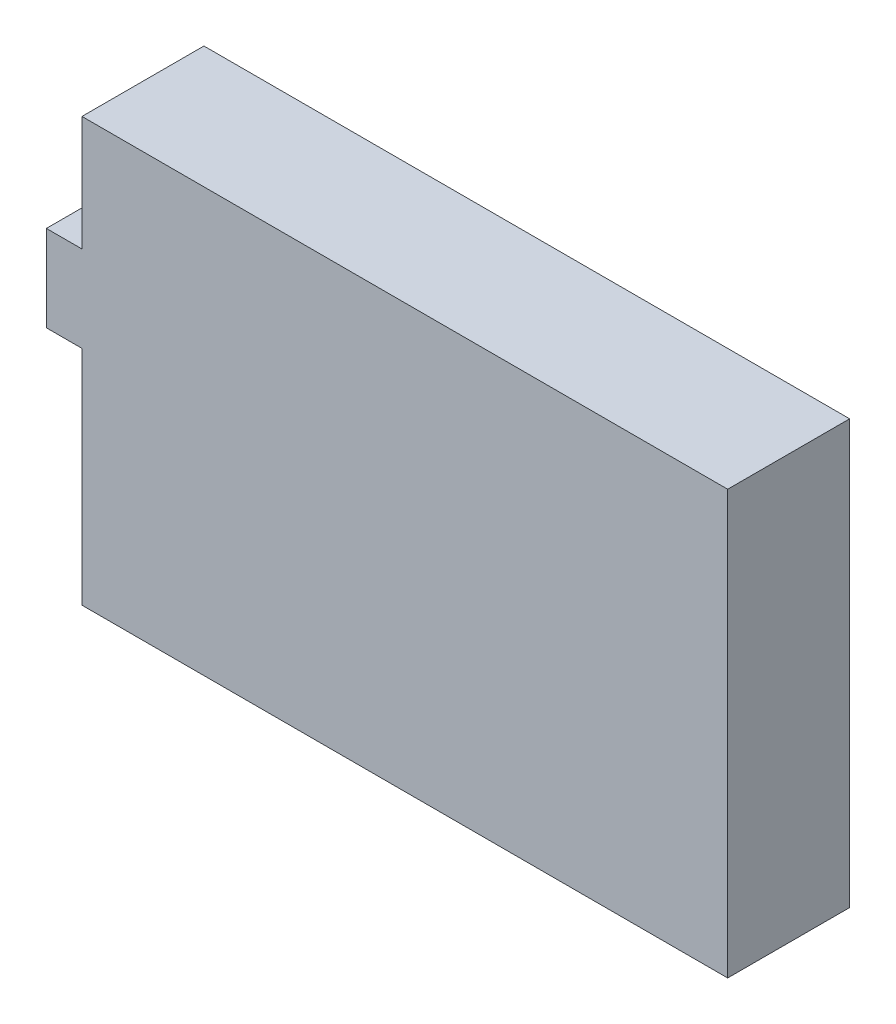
ISO-10303-21;
HEADER;
FILE_DESCRIPTION(('STEP AP214'),'2;1');
FILE_NAME('part.step','',(''),(''),'','','');
FILE_SCHEMA(('AUTOMOTIVE_DESIGN { 1 0 10303 214 1 1 1 1 }'));
ENDSEC;
DATA;
#1=APPLICATION_CONTEXT('core data for automotive mechanical design processes');
#2=APPLICATION_PROTOCOL_DEFINITION('international standard','automotive_design',2000,#1);
#3=PRODUCT_CONTEXT('',#1,'mechanical');
#4=PRODUCT('Part','Part','',(#3));
#5=PRODUCT_RELATED_PRODUCT_CATEGORY('part','',(#4));
#6=PRODUCT_DEFINITION_FORMATION('','',#4);
#7=PRODUCT_DEFINITION_CONTEXT('part definition',#1,'design');
#8=PRODUCT_DEFINITION('design','',#6,#7);
#9=PRODUCT_DEFINITION_SHAPE('','',#8);
#10=(LENGTH_UNIT() NAMED_UNIT(*) SI_UNIT(.MILLI.,.METRE.));
#11=(NAMED_UNIT(*) PLANE_ANGLE_UNIT() SI_UNIT($,.RADIAN.));
#12=(NAMED_UNIT(*) SI_UNIT($,.STERADIAN.) SOLID_ANGLE_UNIT());
#13=UNCERTAINTY_MEASURE_WITH_UNIT(LENGTH_MEASURE(1.E-05),#10,'distance_accuracy_value','');
#14=(GEOMETRIC_REPRESENTATION_CONTEXT(3) GLOBAL_UNCERTAINTY_ASSIGNED_CONTEXT((#13)) GLOBAL_UNIT_ASSIGNED_CONTEXT((#10,
#11,#12)) REPRESENTATION_CONTEXT('',''));
#15=CARTESIAN_POINT('',(0.,0.,0.));
#16=DIRECTION('',(0.,0.,1.));
#17=DIRECTION('',(1.,0.,0.));
#18=AXIS2_PLACEMENT_3D('',#15,#16,#17);
#19=CARTESIAN_POINT('',(-45.,13.2475826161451,17.));
#20=DIRECTION('',(0.,1.,0.));
#21=DIRECTION('',(0.,0.,1.));
#22=AXIS2_PLACEMENT_3D('',#19,#20,#21);
#23=PLANE('',#22);
#24=DIRECTION('',(1.,0.,0.));
#25=VECTOR('',#24,1.);
#26=CARTESIAN_POINT('',(-45.,13.2475826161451,0.));
#27=LINE('',#26,#25);
#28=CARTESIAN_POINT('',(-45.,13.2475826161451,0.));
#29=VERTEX_POINT('',#28);
#30=CARTESIAN_POINT('',(45.,13.2475826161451,0.));
#31=VERTEX_POINT('',#30);
#32=EDGE_CURVE('E133',#29,#31,#27,.T.);
#33=ORIENTED_EDGE('',*,*,#32,.F.);
#34=DIRECTION('',(0.,0.,-1.));
#35=VECTOR('',#34,1.);
#36=CARTESIAN_POINT('',(-45.,13.2475826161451,17.));
#37=LINE('',#36,#35);
#38=CARTESIAN_POINT('',(-45.,13.2475826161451,17.));
#39=VERTEX_POINT('',#38);
#40=EDGE_CURVE('E11',#39,#29,#37,.T.);
#41=ORIENTED_EDGE('',*,*,#40,.F.);
#42=DIRECTION('',(1.,0.,0.));
#43=VECTOR('',#42,1.);
#44=CARTESIAN_POINT('',(-45.,13.2475826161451,17.));
#45=LINE('',#44,#43);
#46=CARTESIAN_POINT('',(45.,13.2475826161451,17.));
#47=VERTEX_POINT('',#46);
#48=EDGE_CURVE('E150',#39,#47,#45,.T.);
#49=ORIENTED_EDGE('',*,*,#48,.T.);
#50=DIRECTION('',(0.,0.,-1.));
#51=VECTOR('',#50,1.);
#52=CARTESIAN_POINT('',(45.,13.2475826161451,17.));
#53=LINE('',#52,#51);
#54=EDGE_CURVE('E37',#47,#31,#53,.T.);
#55=ORIENTED_EDGE('',*,*,#54,.T.);
#56=EDGE_LOOP('',(#33,#41,#49,#55));
#57=FACE_BOUND('',#56,.T.);
#58=ADVANCED_FACE('F34',(#57),#23,.T.);
#59=CARTESIAN_POINT('',(-45.,13.2475826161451,17.));
#60=DIRECTION('',(1.,0.,0.));
#61=DIRECTION('',(0.,1.,0.));
#62=AXIS2_PLACEMENT_3D('',#59,#60,#61);
#63=PLANE('',#62);
#64=DIRECTION('',(0.,-1.,0.));
#65=VECTOR('',#64,1.);
#66=CARTESIAN_POINT('',(-45.,13.2475826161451,0.));
#67=LINE('',#66,#65);
#68=CARTESIAN_POINT('',(-45.,-2.75241738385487,0.));
#69=VERTEX_POINT('',#68);
#70=EDGE_CURVE('E79',#29,#69,#67,.T.);
#71=ORIENTED_EDGE('',*,*,#70,.T.);
#72=DIRECTION('',(0.,0.,-1.));
#73=VECTOR('',#72,1.);
#74=CARTESIAN_POINT('',(-45.,-2.75241738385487,17.));
#75=LINE('',#74,#73);
#76=CARTESIAN_POINT('',(-45.,-2.75241738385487,17.));
#77=VERTEX_POINT('',#76);
#78=EDGE_CURVE('E43',#77,#69,#75,.T.);
#79=ORIENTED_EDGE('',*,*,#78,.F.);
#80=DIRECTION('',(0.,-1.,0.));
#81=VECTOR('',#80,1.);
#82=CARTESIAN_POINT('',(-45.,13.2475826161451,17.));
#83=LINE('',#82,#81);
#84=EDGE_CURVE('E111',#39,#77,#83,.T.);
#85=ORIENTED_EDGE('',*,*,#84,.F.);
#86=ORIENTED_EDGE('',*,*,#40,.T.);
#87=EDGE_LOOP('',(#71,#79,#85,#86));
#88=FACE_BOUND('',#87,.T.);
#89=ADVANCED_FACE('F188',(#88),#63,.F.);
#90=CARTESIAN_POINT('',(-45.,-2.75241738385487,17.));
#91=DIRECTION('',(0.,-1.,0.));
#92=DIRECTION('',(0.,0.,-1.));
#93=AXIS2_PLACEMENT_3D('',#90,#91,#92);
#94=PLANE('',#93);
#95=DIRECTION('',(-1.,0.,0.));
#96=VECTOR('',#95,1.);
#97=CARTESIAN_POINT('',(-45.,-2.75241738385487,0.));
#98=LINE('',#97,#96);
#99=CARTESIAN_POINT('',(-49.9630099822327,-2.75241738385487,0.));
#100=VERTEX_POINT('',#99);
#101=EDGE_CURVE('E118',#69,#100,#98,.T.);
#102=ORIENTED_EDGE('',*,*,#101,.T.);
#103=DIRECTION('',(0.,0.,-1.));
#104=VECTOR('',#103,1.);
#105=CARTESIAN_POINT('',(-49.9630099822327,-2.75241738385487,17.));
#106=LINE('',#105,#104);
#107=CARTESIAN_POINT('',(-49.9630099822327,-2.75241738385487,17.));
#108=VERTEX_POINT('',#107);
#109=EDGE_CURVE('E115',#108,#100,#106,.T.);
#110=ORIENTED_EDGE('',*,*,#109,.F.);
#111=DIRECTION('',(-1.,0.,0.));
#112=VECTOR('',#111,1.);
#113=CARTESIAN_POINT('',(-45.,-2.75241738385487,17.));
#114=LINE('',#113,#112);
#115=EDGE_CURVE('E103',#77,#108,#114,.T.);
#116=ORIENTED_EDGE('',*,*,#115,.F.);
#117=ORIENTED_EDGE('',*,*,#78,.T.);
#118=EDGE_LOOP('',(#102,#110,#116,#117));
#119=FACE_BOUND('',#118,.T.);
#120=ADVANCED_FACE('F116',(#119),#94,.F.);
#121=CARTESIAN_POINT('',(-49.9630099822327,-2.75241738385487,17.));
#122=DIRECTION('',(1.,0.,0.));
#123=DIRECTION('',(0.,0.,-1.));
#124=AXIS2_PLACEMENT_3D('',#121,#122,#123);
#125=PLANE('',#124);
#126=DIRECTION('',(0.,-1.,0.));
#127=VECTOR('',#126,1.);
#128=CARTESIAN_POINT('',(-49.9630099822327,-2.75241738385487,0.));
#129=LINE('',#128,#127);
#130=CARTESIAN_POINT('',(-49.9630099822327,-14.7524173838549,0.));
#131=VERTEX_POINT('',#130);
#132=EDGE_CURVE('E147',#100,#131,#129,.T.);
#133=ORIENTED_EDGE('',*,*,#132,.T.);
#134=DIRECTION('',(0.,0.,-1.));
#135=VECTOR('',#134,1.);
#136=CARTESIAN_POINT('',(-49.9630099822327,-14.7524173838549,17.));
#137=LINE('',#136,#135);
#138=CARTESIAN_POINT('',(-49.9630099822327,-14.7524173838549,17.));
#139=VERTEX_POINT('',#138);
#140=EDGE_CURVE('E122',#139,#131,#137,.T.);
#141=ORIENTED_EDGE('',*,*,#140,.F.);
#142=DIRECTION('',(0.,-1.,0.));
#143=VECTOR('',#142,1.);
#144=CARTESIAN_POINT('',(-49.9630099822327,-2.75241738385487,17.));
#145=LINE('',#144,#143);
#146=EDGE_CURVE('E109',#108,#139,#145,.T.);
#147=ORIENTED_EDGE('',*,*,#146,.F.);
#148=ORIENTED_EDGE('',*,*,#109,.T.);
#149=EDGE_LOOP('',(#133,#141,#147,#148));
#150=FACE_BOUND('',#149,.T.);
#151=ADVANCED_FACE('F124',(#150),#125,.F.);
#152=CARTESIAN_POINT('',(-45.,-14.7524173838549,17.));
#153=DIRECTION('',(0.,-1.,0.));
#154=DIRECTION('',(0.,0.,-1.));
#155=AXIS2_PLACEMENT_3D('',#152,#153,#154);
#156=PLANE('',#155);
#157=DIRECTION('',(-1.,0.,0.));
#158=VECTOR('',#157,1.);
#159=CARTESIAN_POINT('',(-45.,-14.7524173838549,0.));
#160=LINE('',#159,#158);
#161=CARTESIAN_POINT('',(-45.,-14.7524173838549,0.));
#162=VERTEX_POINT('',#161);
#163=EDGE_CURVE('E144',#162,#131,#160,.T.);
#164=ORIENTED_EDGE('',*,*,#163,.F.);
#165=DIRECTION('',(0.,0.,-1.));
#166=VECTOR('',#165,1.);
#167=CARTESIAN_POINT('',(-45.,-14.7524173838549,17.));
#168=LINE('',#167,#166);
#169=CARTESIAN_POINT('',(-45.,-14.7524173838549,17.));
#170=VERTEX_POINT('',#169);
#171=EDGE_CURVE('E154',#170,#162,#168,.T.);
#172=ORIENTED_EDGE('',*,*,#171,.F.);
#173=DIRECTION('',(-1.,0.,0.));
#174=VECTOR('',#173,1.);
#175=CARTESIAN_POINT('',(-45.,-14.7524173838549,17.));
#176=LINE('',#175,#174);
#177=EDGE_CURVE('E126',#170,#139,#176,.T.);
#178=ORIENTED_EDGE('',*,*,#177,.T.);
#179=ORIENTED_EDGE('',*,*,#140,.T.);
#180=EDGE_LOOP('',(#164,#172,#178,#179));
#181=FACE_BOUND('',#180,.T.);
#182=ADVANCED_FACE('F167',(#181),#156,.T.);
#183=CARTESIAN_POINT('',(-45.,-14.7524173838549,17.));
#184=DIRECTION('',(1.,0.,0.));
#185=DIRECTION('',(0.,0.,-1.));
#186=AXIS2_PLACEMENT_3D('',#183,#184,#185);
#187=PLANE('',#186);
#188=DIRECTION('',(0.,-1.,0.));
#189=VECTOR('',#188,1.);
#190=CARTESIAN_POINT('',(-45.,-14.7524173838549,0.));
#191=LINE('',#190,#189);
#192=CARTESIAN_POINT('',(-45.,-45.7524173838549,0.));
#193=VERTEX_POINT('',#192);
#194=EDGE_CURVE('E142',#162,#193,#191,.T.);
#195=ORIENTED_EDGE('',*,*,#194,.T.);
#196=DIRECTION('',(0.,0.,-1.));
#197=VECTOR('',#196,1.);
#198=CARTESIAN_POINT('',(-45.,-45.7524173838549,17.));
#199=LINE('',#198,#197);
#200=CARTESIAN_POINT('',(-45.,-45.7524173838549,17.));
#201=VERTEX_POINT('',#200);
#202=EDGE_CURVE('E156',#201,#193,#199,.T.);
#203=ORIENTED_EDGE('',*,*,#202,.F.);
#204=DIRECTION('',(0.,-1.,0.));
#205=VECTOR('',#204,1.);
#206=CARTESIAN_POINT('',(-45.,-14.7524173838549,17.));
#207=LINE('',#206,#205);
#208=EDGE_CURVE('E128',#170,#201,#207,.T.);
#209=ORIENTED_EDGE('',*,*,#208,.F.);
#210=ORIENTED_EDGE('',*,*,#171,.T.);
#211=EDGE_LOOP('',(#195,#203,#209,#210));
#212=FACE_BOUND('',#211,.T.);
#213=ADVANCED_FACE('F173',(#212),#187,.F.);
#214=CARTESIAN_POINT('',(-45.,-45.7524173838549,17.));
#215=DIRECTION('',(0.,1.,0.));
#216=DIRECTION('',(0.,0.,1.));
#217=AXIS2_PLACEMENT_3D('',#214,#215,#216);
#218=PLANE('',#217);
#219=DIRECTION('',(1.,0.,0.));
#220=VECTOR('',#219,1.);
#221=CARTESIAN_POINT('',(-45.,-45.7524173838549,0.));
#222=LINE('',#221,#220);
#223=CARTESIAN_POINT('',(45.,-45.7524173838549,0.));
#224=VERTEX_POINT('',#223);
#225=EDGE_CURVE('E139',#193,#224,#222,.T.);
#226=ORIENTED_EDGE('',*,*,#225,.T.);
#227=DIRECTION('',(0.,0.,-1.));
#228=VECTOR('',#227,1.);
#229=CARTESIAN_POINT('',(45.,-45.7524173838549,17.));
#230=LINE('',#229,#228);
#231=CARTESIAN_POINT('',(45.,-45.7524173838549,17.));
#232=VERTEX_POINT('',#231);
#233=EDGE_CURVE('E158',#232,#224,#230,.T.);
#234=ORIENTED_EDGE('',*,*,#233,.F.);
#235=DIRECTION('',(1.,0.,0.));
#236=VECTOR('',#235,1.);
#237=CARTESIAN_POINT('',(-45.,-45.7524173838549,17.));
#238=LINE('',#237,#236);
#239=EDGE_CURVE('E171',#201,#232,#238,.T.);
#240=ORIENTED_EDGE('',*,*,#239,.F.);
#241=ORIENTED_EDGE('',*,*,#202,.T.);
#242=EDGE_LOOP('',(#226,#234,#240,#241));
#243=FACE_BOUND('',#242,.T.);
#244=ADVANCED_FACE('F175',(#243),#218,.F.);
#245=CARTESIAN_POINT('',(45.,13.2475826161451,17.));
#246=DIRECTION('',(1.,0.,0.));
#247=DIRECTION('',(0.,1.,0.));
#248=AXIS2_PLACEMENT_3D('',#245,#246,#247);
#249=PLANE('',#248);
#250=DIRECTION('',(0.,-1.,0.));
#251=VECTOR('',#250,1.);
#252=CARTESIAN_POINT('',(45.,13.2475826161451,0.));
#253=LINE('',#252,#251);
#254=EDGE_CURVE('E136',#31,#224,#253,.T.);
#255=ORIENTED_EDGE('',*,*,#254,.F.);
#256=ORIENTED_EDGE('',*,*,#54,.F.);
#257=DIRECTION('',(0.,-1.,0.));
#258=VECTOR('',#257,1.);
#259=CARTESIAN_POINT('',(45.,13.2475826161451,17.));
#260=LINE('',#259,#258);
#261=EDGE_CURVE('E176',#47,#232,#260,.T.);
#262=ORIENTED_EDGE('',*,*,#261,.T.);
#263=ORIENTED_EDGE('',*,*,#233,.T.);
#264=EDGE_LOOP('',(#255,#256,#262,#263));
#265=FACE_BOUND('',#264,.T.);
#266=ADVANCED_FACE('F160',(#265),#249,.T.);
#267=CARTESIAN_POINT('',(0.,0.,17.));
#268=DIRECTION('',(0.,0.,-1.));
#269=DIRECTION('',(-1.,0.,0.));
#270=AXIS2_PLACEMENT_3D('',#267,#268,#269);
#271=PLANE('',#270);
#272=ORIENTED_EDGE('',*,*,#48,.F.);
#273=ORIENTED_EDGE('',*,*,#84,.T.);
#274=ORIENTED_EDGE('',*,*,#115,.T.);
#275=ORIENTED_EDGE('',*,*,#146,.T.);
#276=ORIENTED_EDGE('',*,*,#177,.F.);
#277=ORIENTED_EDGE('',*,*,#208,.T.);
#278=ORIENTED_EDGE('',*,*,#239,.T.);
#279=ORIENTED_EDGE('',*,*,#261,.F.);
#280=EDGE_LOOP('',(#272,#273,#274,#275,#276,#277,#278,#279));
#281=FACE_BOUND('',#280,.T.);
#282=ADVANCED_FACE('F106',(#281),#271,.F.);
#283=CARTESIAN_POINT('',(0.,0.,0.));
#284=DIRECTION('',(0.,0.,-1.));
#285=DIRECTION('',(-1.,0.,0.));
#286=AXIS2_PLACEMENT_3D('',#283,#284,#285);
#287=PLANE('',#286);
#288=ORIENTED_EDGE('',*,*,#32,.T.);
#289=ORIENTED_EDGE('',*,*,#254,.T.);
#290=ORIENTED_EDGE('',*,*,#225,.F.);
#291=ORIENTED_EDGE('',*,*,#194,.F.);
#292=ORIENTED_EDGE('',*,*,#163,.T.);
#293=ORIENTED_EDGE('',*,*,#132,.F.);
#294=ORIENTED_EDGE('',*,*,#101,.F.);
#295=ORIENTED_EDGE('',*,*,#70,.F.);
#296=EDGE_LOOP('',(#288,#289,#290,#291,#292,#293,#294,#295));
#297=FACE_BOUND('',#296,.T.);
#298=ADVANCED_FACE('F163',(#297),#287,.T.);
#299=CLOSED_SHELL('',(#58,#89,#120,#151,#182,#213,#244,#266,#282,#298));
#300=MANIFOLD_SOLID_BREP('B2',#299);
#301=ADVANCED_BREP_SHAPE_REPRESENTATION('',(#18,#300),#14);
#302=SHAPE_DEFINITION_REPRESENTATION(#9,#301);
ENDSEC;
END-ISO-10303-21;
